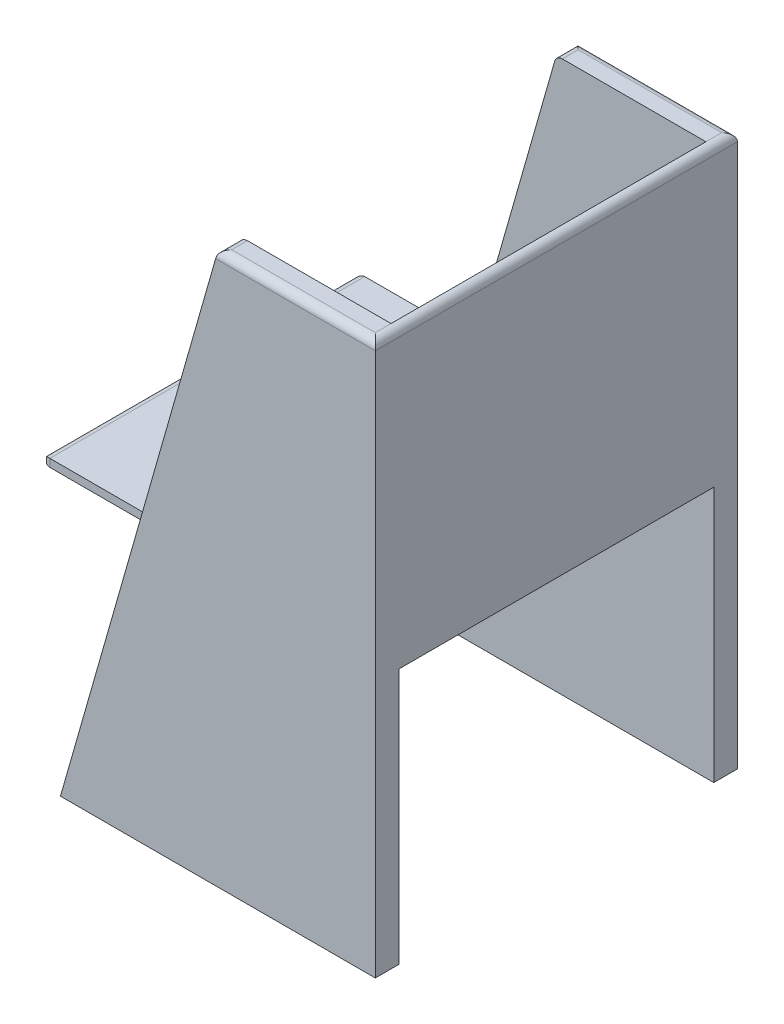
ISO-10303-21;
HEADER;
FILE_DESCRIPTION(('STEP AP214'),'2;1');
FILE_NAME('part.step','',(''),(''),'','','');
FILE_SCHEMA(('AUTOMOTIVE_DESIGN { 1 0 10303 214 1 1 1 1 }'));
ENDSEC;
DATA;
#1=APPLICATION_CONTEXT('core data for automotive mechanical design processes');
#2=APPLICATION_PROTOCOL_DEFINITION('international standard','automotive_design',2000,#1);
#3=PRODUCT_CONTEXT('',#1,'mechanical');
#4=PRODUCT('Part','Part','',(#3));
#5=PRODUCT_RELATED_PRODUCT_CATEGORY('part','',(#4));
#6=PRODUCT_DEFINITION_FORMATION('','',#4);
#7=PRODUCT_DEFINITION_CONTEXT('part definition',#1,'design');
#8=PRODUCT_DEFINITION('design','',#6,#7);
#9=PRODUCT_DEFINITION_SHAPE('','',#8);
#10=(LENGTH_UNIT() NAMED_UNIT(*) SI_UNIT(.MILLI.,.METRE.));
#11=(NAMED_UNIT(*) PLANE_ANGLE_UNIT() SI_UNIT($,.RADIAN.));
#12=(NAMED_UNIT(*) SI_UNIT($,.STERADIAN.) SOLID_ANGLE_UNIT());
#13=UNCERTAINTY_MEASURE_WITH_UNIT(LENGTH_MEASURE(1.E-05),#10,'distance_accuracy_value','');
#14=(GEOMETRIC_REPRESENTATION_CONTEXT(3) GLOBAL_UNCERTAINTY_ASSIGNED_CONTEXT((#13)) GLOBAL_UNIT_ASSIGNED_CONTEXT((#10,
#11,#12)) REPRESENTATION_CONTEXT('',''));
#15=CARTESIAN_POINT('',(0.,0.,0.));
#16=DIRECTION('',(0.,0.,1.));
#17=DIRECTION('',(1.,0.,0.));
#18=AXIS2_PLACEMENT_3D('',#15,#16,#17);
#19=CARTESIAN_POINT('',(400.,700.,30.));
#20=DIRECTION('',(0.,-1.,0.));
#21=DIRECTION('',(0.,0.,-1.));
#22=AXIS2_PLACEMENT_3D('',#19,#20,#21);
#23=PLANE('',#22);
#24=DIRECTION('',(-1.,0.,0.));
#25=VECTOR('',#24,1.);
#26=CARTESIAN_POINT('',(400.,700.,430.));
#27=LINE('',#26,#25);
#28=CARTESIAN_POINT('',(390.,700.,430.));
#29=VERTEX_POINT('',#28);
#30=CARTESIAN_POINT('',(207.543014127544,700.,430.));
#31=VERTEX_POINT('',#30);
#32=EDGE_CURVE('E192',#29,#31,#27,.T.);
#33=ORIENTED_EDGE('',*,*,#32,.T.);
#34=DIRECTION('',(0.,0.,1.));
#35=VECTOR('',#34,1.);
#36=CARTESIAN_POINT('',(207.543014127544,700.,460.));
#37=LINE('',#36,#35);
#38=CARTESIAN_POINT('',(207.543014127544,700.,450.));
#39=VERTEX_POINT('',#38);
#40=EDGE_CURVE('E213',#31,#39,#37,.T.);
#41=ORIENTED_EDGE('',*,*,#40,.T.);
#42=DIRECTION('',(-1.,0.,0.));
#43=VECTOR('',#42,1.);
#44=CARTESIAN_POINT('',(400.,700.,450.));
#45=LINE('',#44,#43);
#46=CARTESIAN_POINT('',(390.,700.,450.));
#47=VERTEX_POINT('',#46);
#48=EDGE_CURVE('E211',#39,#47,#45,.F.);
#49=ORIENTED_EDGE('',*,*,#48,.T.);
#50=DIRECTION('',(0.,0.,-1.));
#51=VECTOR('',#50,1.);
#52=CARTESIAN_POINT('',(390.,700.,30.));
#53=LINE('',#52,#51);
#54=EDGE_CURVE('E209',#47,#29,#53,.T.);
#55=ORIENTED_EDGE('',*,*,#54,.T.);
#56=EDGE_LOOP('',(#33,#41,#49,#55));
#57=FACE_BOUND('',#56,.T.);
#58=ADVANCED_FACE('F33',(#57),#23,.F.);
#59=CARTESIAN_POINT('',(0.,0.,30.));
#60=DIRECTION('',(0.,0.,1.));
#61=DIRECTION('',(1.,0.,0.));
#62=AXIS2_PLACEMENT_3D('',#59,#60,#61);
#63=PLANE('',#62);
#64=DIRECTION('',(1.,0.,0.));
#65=VECTOR('',#64,1.);
#66=CARTESIAN_POINT('',(0.,325.,30.));
#67=LINE('',#66,#65);
#68=CARTESIAN_POINT('',(92.8571428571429,325.,29.9999999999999));
#69=VERTEX_POINT('',#68);
#70=CARTESIAN_POINT('',(400.,325.,30.));
#71=VERTEX_POINT('',#70);
#72=EDGE_CURVE('E289',#69,#71,#67,.T.);
#73=ORIENTED_EDGE('',*,*,#72,.F.);
#74=DIRECTION('',(-0.274721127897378,-0.961523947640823,0.));
#75=VECTOR('',#74,1.);
#76=CARTESIAN_POINT('',(200.,700.,30.));
#77=LINE('',#76,#75);
#78=CARTESIAN_POINT('',(0.,0.,30.));
#79=VERTEX_POINT('',#78);
#80=EDGE_CURVE('E273',#69,#79,#77,.T.);
#81=ORIENTED_EDGE('',*,*,#80,.T.);
#82=DIRECTION('',(1.,0.,0.));
#83=VECTOR('',#82,1.);
#84=CARTESIAN_POINT('',(0.,0.,30.));
#85=LINE('',#84,#83);
#86=CARTESIAN_POINT('',(400.,0.,30.));
#87=VERTEX_POINT('',#86);
#88=EDGE_CURVE('E283',#79,#87,#85,.T.);
#89=ORIENTED_EDGE('',*,*,#88,.T.);
#90=DIRECTION('',(0.,1.,0.));
#91=VECTOR('',#90,1.);
#92=CARTESIAN_POINT('',(400.,0.,30.));
#93=LINE('',#92,#91);
#94=EDGE_CURVE('E274',#87,#71,#93,.T.);
#95=ORIENTED_EDGE('',*,*,#94,.T.);
#96=EDGE_LOOP('',(#73,#81,#89,#95));
#97=FACE_BOUND('',#96,.T.);
#98=ADVANCED_FACE('F342',(#97),#63,.T.);
#99=CARTESIAN_POINT('',(0.,0.,430.));
#100=DIRECTION('',(0.,0.,-1.));
#101=DIRECTION('',(1.,0.,0.));
#102=AXIS2_PLACEMENT_3D('',#99,#100,#101);
#103=PLANE('',#102);
#104=DIRECTION('',(-0.274721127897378,-0.961523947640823,0.));
#105=VECTOR('',#104,1.);
#106=CARTESIAN_POINT('',(200.,700.,430.));
#107=LINE('',#106,#105);
#108=CARTESIAN_POINT('',(92.8571428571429,325.,430.));
#109=VERTEX_POINT('',#108);
#110=CARTESIAN_POINT('',(0.,0.,430.));
#111=VERTEX_POINT('',#110);
#112=EDGE_CURVE('E611',#109,#111,#107,.T.);
#113=ORIENTED_EDGE('',*,*,#112,.F.);
#114=DIRECTION('',(1.,0.,0.));
#115=VECTOR('',#114,1.);
#116=CARTESIAN_POINT('',(390.,325.,430.));
#117=LINE('',#116,#115);
#118=CARTESIAN_POINT('',(400.,325.,430.));
#119=VERTEX_POINT('',#118);
#120=EDGE_CURVE('E332',#109,#119,#117,.T.);
#121=ORIENTED_EDGE('',*,*,#120,.T.);
#122=DIRECTION('',(0.,1.,0.));
#123=VECTOR('',#122,1.);
#124=CARTESIAN_POINT('',(400.,0.,430.));
#125=LINE('',#124,#123);
#126=CARTESIAN_POINT('',(400.,0.,430.));
#127=VERTEX_POINT('',#126);
#128=EDGE_CURVE('E326',#127,#119,#125,.T.);
#129=ORIENTED_EDGE('',*,*,#128,.F.);
#130=DIRECTION('',(1.,0.,0.));
#131=VECTOR('',#130,1.);
#132=CARTESIAN_POINT('',(0.,0.,430.));
#133=LINE('',#132,#131);
#134=EDGE_CURVE('E606',#111,#127,#133,.T.);
#135=ORIENTED_EDGE('',*,*,#134,.F.);
#136=EDGE_LOOP('',(#113,#121,#129,#135));
#137=FACE_BOUND('',#136,.T.);
#138=ADVANCED_FACE('F370',(#137),#103,.T.);
#139=CARTESIAN_POINT('',(400.,0.,30.));
#140=DIRECTION('',(-1.,0.,0.));
#141=DIRECTION('',(0.,0.,1.));
#142=AXIS2_PLACEMENT_3D('',#139,#140,#141);
#143=PLANE('',#142);
#144=DIRECTION('',(0.,1.,0.));
#145=VECTOR('',#144,1.);
#146=CARTESIAN_POINT('',(400.,0.,0.));
#147=LINE('',#146,#145);
#148=CARTESIAN_POINT('',(400.,0.,0.));
#149=VERTEX_POINT('',#148);
#150=CARTESIAN_POINT('',(400.,690.,0.));
#151=VERTEX_POINT('',#150);
#152=EDGE_CURVE('E285',#149,#151,#147,.T.);
#153=ORIENTED_EDGE('',*,*,#152,.T.);
#154=DIRECTION('',(0.,0.,-1.));
#155=VECTOR('',#154,1.);
#156=CARTESIAN_POINT('',(400.,690.,30.));
#157=LINE('',#156,#155);
#158=CARTESIAN_POINT('',(400.,690.,460.));
#159=VERTEX_POINT('',#158);
#160=EDGE_CURVE('E230',#151,#159,#157,.F.);
#161=ORIENTED_EDGE('',*,*,#160,.T.);
#162=DIRECTION('',(0.,1.,0.));
#163=VECTOR('',#162,1.);
#164=CARTESIAN_POINT('',(400.,0.,460.));
#165=LINE('',#164,#163);
#166=CARTESIAN_POINT('',(400.,0.,460.));
#167=VERTEX_POINT('',#166);
#168=EDGE_CURVE('E309',#167,#159,#165,.T.);
#169=ORIENTED_EDGE('',*,*,#168,.F.);
#170=DIRECTION('',(0.,0.,1.));
#171=VECTOR('',#170,1.);
#172=CARTESIAN_POINT('',(400.,0.,430.));
#173=LINE('',#172,#171);
#174=EDGE_CURVE('E330',#127,#167,#173,.T.);
#175=ORIENTED_EDGE('',*,*,#174,.F.);
#176=ORIENTED_EDGE('',*,*,#128,.T.);
#177=DIRECTION('',(0.,0.,-1.));
#178=VECTOR('',#177,1.);
#179=CARTESIAN_POINT('',(400.,325.,450.));
#180=LINE('',#179,#178);
#181=EDGE_CURVE('E334',#119,#71,#180,.T.);
#182=ORIENTED_EDGE('',*,*,#181,.T.);
#183=ORIENTED_EDGE('',*,*,#94,.F.);
#184=DIRECTION('',(0.,0.,-1.));
#185=VECTOR('',#184,1.);
#186=CARTESIAN_POINT('',(400.,0.,30.));
#187=LINE('',#186,#185);
#188=EDGE_CURVE('E200',#87,#149,#187,.T.);
#189=ORIENTED_EDGE('',*,*,#188,.T.);
#190=EDGE_LOOP('',(#153,#161,#169,#175,#176,#182,#183,#189));
#191=FACE_BOUND('',#190,.T.);
#192=ADVANCED_FACE('F296',(#191),#143,.F.);
#193=DIRECTION('',(-1.,0.,0.));
#194=VECTOR('',#193,1.);
#195=CARTESIAN_POINT('',(400.,700.,30.));
#196=LINE('',#195,#194);
#197=CARTESIAN_POINT('',(390.,700.,30.));
#198=VERTEX_POINT('',#197);
#199=CARTESIAN_POINT('',(207.543014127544,700.,30.));
#200=VERTEX_POINT('',#199);
#201=EDGE_CURVE('E269',#198,#200,#196,.T.);
#202=ORIENTED_EDGE('',*,*,#201,.F.);
#203=DIRECTION('',(0.,0.,-1.));
#204=VECTOR('',#203,1.);
#205=CARTESIAN_POINT('',(390.,700.,30.));
#206=LINE('',#205,#204);
#207=CARTESIAN_POINT('',(390.,700.,10.));
#208=VERTEX_POINT('',#207);
#209=EDGE_CURVE('E207',#198,#208,#206,.T.);
#210=ORIENTED_EDGE('',*,*,#209,.T.);
#211=DIRECTION('',(-1.,0.,0.));
#212=VECTOR('',#211,1.);
#213=CARTESIAN_POINT('',(400.,700.,10.));
#214=LINE('',#213,#212);
#215=CARTESIAN_POINT('',(207.543014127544,700.,10.));
#216=VERTEX_POINT('',#215);
#217=EDGE_CURVE('E205',#208,#216,#214,.T.);
#218=ORIENTED_EDGE('',*,*,#217,.T.);
#219=DIRECTION('',(0.,0.,-1.));
#220=VECTOR('',#219,1.);
#221=CARTESIAN_POINT('',(207.543014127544,700.,30.));
#222=LINE('',#221,#220);
#223=EDGE_CURVE('E197',#216,#200,#222,.F.);
#224=ORIENTED_EDGE('',*,*,#223,.T.);
#225=EDGE_LOOP('',(#202,#210,#218,#224));
#226=FACE_BOUND('',#225,.T.);
#227=ADVANCED_FACE('F268',(#226),#23,.F.);
#228=CARTESIAN_POINT('',(200.,700.,30.));
#229=DIRECTION('',(0.961523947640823,-0.274721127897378,0.));
#230=DIRECTION('',(0.274721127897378,0.961523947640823,0.));
#231=AXIS2_PLACEMENT_3D('',#228,#229,#230);
#232=PLANE('',#231);
#233=DIRECTION('',(0.,0.,-1.));
#234=VECTOR('',#233,1.);
#235=CARTESIAN_POINT('',(197.927774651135,692.747211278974,30.));
#236=LINE('',#235,#234);
#237=CARTESIAN_POINT('',(197.927774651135,692.747211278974,30.));
#238=VERTEX_POINT('',#237);
#239=CARTESIAN_POINT('',(197.927774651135,692.747211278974,0.384760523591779));
#240=VERTEX_POINT('',#239);
#241=EDGE_CURVE('E224',#238,#240,#236,.T.);
#242=ORIENTED_EDGE('',*,*,#241,.T.);
#243=CARTESIAN_POINT('',(197.142857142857,690.,10.));
#244=DIRECTION('',(0.961523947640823,-0.274721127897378,0.));
#245=DIRECTION('',(-0.274721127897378,-0.961523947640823,0.));
#246=AXIS2_PLACEMENT_3D('',#243,#244,#245);
#247=ELLIPSE('',#246,10.4001569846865,10.);
#248=CARTESIAN_POINT('',(197.142857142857,690.,0.));
#249=VERTEX_POINT('',#248);
#250=EDGE_CURVE('E226',#240,#249,#247,.F.);
#251=ORIENTED_EDGE('',*,*,#250,.T.);
#252=DIRECTION('',(-0.274721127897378,-0.961523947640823,0.));
#253=VECTOR('',#252,1.);
#254=CARTESIAN_POINT('',(200.,700.,0.));
#255=LINE('',#254,#253);
#256=CARTESIAN_POINT('',(0.,0.,0.));
#257=VERTEX_POINT('',#256);
#258=EDGE_CURVE('E288',#249,#257,#255,.T.);
#259=ORIENTED_EDGE('',*,*,#258,.T.);
#260=DIRECTION('',(0.,0.,-1.));
#261=VECTOR('',#260,1.);
#262=CARTESIAN_POINT('',(0.,0.,30.));
#263=LINE('',#262,#261);
#264=EDGE_CURVE('E195',#79,#257,#263,.T.);
#265=ORIENTED_EDGE('',*,*,#264,.F.);
#266=ORIENTED_EDGE('',*,*,#80,.F.);
#267=DIRECTION('',(0.274721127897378,0.961523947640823,0.));
#268=VECTOR('',#267,1.);
#269=CARTESIAN_POINT('',(200.,700.,29.9999999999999));
#270=LINE('',#269,#268);
#271=CARTESIAN_POINT('',(95.7142857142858,335.,29.9999999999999));
#272=VERTEX_POINT('',#271);
#273=EDGE_CURVE('E320',#69,#272,#270,.T.);
#274=ORIENTED_EDGE('',*,*,#273,.T.);
#275=EDGE_CURVE('E276',#238,#272,#77,.T.);
#276=ORIENTED_EDGE('',*,*,#275,.F.);
#277=EDGE_LOOP('',(#242,#251,#259,#265,#266,#274,#276));
#278=FACE_BOUND('',#277,.T.);
#279=ADVANCED_FACE('F353',(#278),#232,.F.);
#280=CARTESIAN_POINT('',(0.,0.,30.));
#281=DIRECTION('',(0.,1.,0.));
#282=DIRECTION('',(0.,0.,1.));
#283=AXIS2_PLACEMENT_3D('',#280,#281,#282);
#284=PLANE('',#283);
#285=DIRECTION('',(1.,0.,0.));
#286=VECTOR('',#285,1.);
#287=CARTESIAN_POINT('',(0.,0.,0.));
#288=LINE('',#287,#286);
#289=EDGE_CURVE('E279',#257,#149,#288,.T.);
#290=ORIENTED_EDGE('',*,*,#289,.T.);
#291=ORIENTED_EDGE('',*,*,#188,.F.);
#292=ORIENTED_EDGE('',*,*,#88,.F.);
#293=ORIENTED_EDGE('',*,*,#264,.T.);
#294=EDGE_LOOP('',(#290,#291,#292,#293));
#295=FACE_BOUND('',#294,.T.);
#296=ADVANCED_FACE('F354',(#295),#284,.F.);
#297=ORIENTED_EDGE('',*,*,#201,.T.);
#298=CARTESIAN_POINT('',(207.543014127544,690.,30.));
#299=DIRECTION('',(0.,0.,1.));
#300=DIRECTION('',(1.,0.,0.));
#301=AXIS2_PLACEMENT_3D('',#298,#299,#300);
#302=CIRCLE('',#301,10.);
#303=EDGE_CURVE('E232',#200,#238,#302,.T.);
#304=ORIENTED_EDGE('',*,*,#303,.T.);
#305=ORIENTED_EDGE('',*,*,#275,.T.);
#306=DIRECTION('',(1.,0.,0.));
#307=VECTOR('',#306,1.);
#308=CARTESIAN_POINT('',(390.,335.,30.));
#309=LINE('',#308,#307);
#310=CARTESIAN_POINT('',(390.,335.,30.));
#311=VERTEX_POINT('',#310);
#312=EDGE_CURVE('E178',#272,#311,#309,.T.);
#313=ORIENTED_EDGE('',*,*,#312,.T.);
#314=DIRECTION('',(0.,1.,0.));
#315=VECTOR('',#314,1.);
#316=CARTESIAN_POINT('',(390.,0.,30.));
#317=LINE('',#316,#315);
#318=EDGE_CURVE('E187',#311,#198,#317,.T.);
#319=ORIENTED_EDGE('',*,*,#318,.T.);
#320=EDGE_LOOP('',(#297,#304,#305,#313,#319));
#321=FACE_BOUND('',#320,.T.);
#322=ADVANCED_FACE('F271',(#321),#63,.T.);
#323=CARTESIAN_POINT('',(0.,0.,0.));
#324=DIRECTION('',(0.,0.,1.));
#325=DIRECTION('',(1.,0.,0.));
#326=AXIS2_PLACEMENT_3D('',#323,#324,#325);
#327=PLANE('',#326);
#328=ORIENTED_EDGE('',*,*,#258,.F.);
#329=DIRECTION('',(-1.,0.,0.));
#330=VECTOR('',#329,1.);
#331=CARTESIAN_POINT('',(0.,690.,0.));
#332=LINE('',#331,#330);
#333=EDGE_CURVE('E228',#249,#151,#332,.F.);
#334=ORIENTED_EDGE('',*,*,#333,.T.);
#335=ORIENTED_EDGE('',*,*,#152,.F.);
#336=ORIENTED_EDGE('',*,*,#289,.F.);
#337=EDGE_LOOP('',(#328,#334,#335,#336));
#338=FACE_BOUND('',#337,.T.);
#339=ADVANCED_FACE('F302',(#338),#327,.F.);
#340=CARTESIAN_POINT('',(390.,325.,450.));
#341=DIRECTION('',(0.,-1.,0.));
#342=DIRECTION('',(0.,0.,-1.));
#343=AXIS2_PLACEMENT_3D('',#340,#341,#342);
#344=PLANE('',#343);
#345=DIRECTION('',(0.,0.,-1.));
#346=VECTOR('',#345,1.);
#347=CARTESIAN_POINT('',(-53.4845159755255,325.,430.));
#348=LINE('',#347,#346);
#349=CARTESIAN_POINT('',(-53.4845159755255,325.,420.));
#350=VERTEX_POINT('',#349);
#351=CARTESIAN_POINT('',(-53.4845159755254,325.,39.9999999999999));
#352=VERTEX_POINT('',#351);
#353=EDGE_CURVE('E618',#350,#352,#348,.T.);
#354=ORIENTED_EDGE('',*,*,#353,.T.);
#355=CARTESIAN_POINT('',(-43.4845159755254,325.,39.9999999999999));
#356=DIRECTION('',(0.,-1.,0.));
#357=DIRECTION('',(0.,0.,-1.));
#358=AXIS2_PLACEMENT_3D('',#355,#356,#357);
#359=CIRCLE('',#358,10.);
#360=CARTESIAN_POINT('',(-43.4845159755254,325.,29.9999999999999));
#361=VERTEX_POINT('',#360);
#362=EDGE_CURVE('E50',#352,#361,#359,.T.);
#363=ORIENTED_EDGE('',*,*,#362,.T.);
#364=DIRECTION('',(1.,0.,0.));
#365=VECTOR('',#364,1.);
#366=CARTESIAN_POINT('',(390.,325.,30.));
#367=LINE('',#366,#365);
#368=EDGE_CURVE('E188',#361,#69,#367,.T.);
#369=ORIENTED_EDGE('',*,*,#368,.T.);
#370=ORIENTED_EDGE('',*,*,#72,.T.);
#371=ORIENTED_EDGE('',*,*,#181,.F.);
#372=ORIENTED_EDGE('',*,*,#120,.F.);
#373=DIRECTION('',(-1.,0.,0.));
#374=VECTOR('',#373,1.);
#375=CARTESIAN_POINT('',(390.,325.,430.));
#376=LINE('',#375,#374);
#377=CARTESIAN_POINT('',(-43.4845159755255,325.,430.));
#378=VERTEX_POINT('',#377);
#379=EDGE_CURVE('E243',#109,#378,#376,.T.);
#380=ORIENTED_EDGE('',*,*,#379,.T.);
#381=CARTESIAN_POINT('',(-43.4845159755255,325.,420.));
#382=DIRECTION('',(0.,-1.,0.));
#383=DIRECTION('',(0.,0.,-1.));
#384=AXIS2_PLACEMENT_3D('',#381,#382,#383);
#385=CIRCLE('',#384,10.);
#386=EDGE_CURVE('E234',#378,#350,#385,.T.);
#387=ORIENTED_EDGE('',*,*,#386,.T.);
#388=EDGE_LOOP('',(#354,#363,#369,#370,#371,#372,#380,#387));
#389=FACE_BOUND('',#388,.T.);
#390=ADVANCED_FACE('F339',(#389),#344,.T.);
#391=CARTESIAN_POINT('',(390.,0.,0.));
#392=DIRECTION('',(1.,0.,0.));
#393=DIRECTION('',(0.,0.,-1.));
#394=AXIS2_PLACEMENT_3D('',#391,#392,#393);
#395=PLANE('',#394);
#396=ORIENTED_EDGE('',*,*,#318,.F.);
#397=DIRECTION('',(0.,0.,1.));
#398=VECTOR('',#397,1.);
#399=CARTESIAN_POINT('',(390.,335.,430.));
#400=LINE('',#399,#398);
#401=CARTESIAN_POINT('',(390.,335.,430.));
#402=VERTEX_POINT('',#401);
#403=EDGE_CURVE('E172',#311,#402,#400,.T.);
#404=ORIENTED_EDGE('',*,*,#403,.T.);
#405=DIRECTION('',(0.,1.,0.));
#406=VECTOR('',#405,1.);
#407=CARTESIAN_POINT('',(390.,0.,430.));
#408=LINE('',#407,#406);
#409=EDGE_CURVE('E185',#402,#29,#408,.T.);
#410=ORIENTED_EDGE('',*,*,#409,.T.);
#411=DIRECTION('',(0.,0.,1.));
#412=VECTOR('',#411,1.);
#413=CARTESIAN_POINT('',(390.,700.,430.));
#414=LINE('',#413,#412);
#415=EDGE_CURVE('E316',#198,#29,#414,.T.);
#416=ORIENTED_EDGE('',*,*,#415,.F.);
#417=EDGE_LOOP('',(#396,#404,#410,#416));
#418=FACE_BOUND('',#417,.T.);
#419=ADVANCED_FACE('F183',(#418),#395,.F.);
#420=CARTESIAN_POINT('',(0.,0.,430.));
#421=DIRECTION('',(0.,-1.,0.));
#422=DIRECTION('',(0.,0.,-1.));
#423=AXIS2_PLACEMENT_3D('',#420,#421,#422);
#424=PLANE('',#423);
#425=DIRECTION('',(1.,0.,0.));
#426=VECTOR('',#425,1.);
#427=CARTESIAN_POINT('',(0.,0.,460.));
#428=LINE('',#427,#426);
#429=CARTESIAN_POINT('',(0.,0.,460.));
#430=VERTEX_POINT('',#429);
#431=EDGE_CURVE('E315',#430,#167,#428,.T.);
#432=ORIENTED_EDGE('',*,*,#431,.F.);
#433=DIRECTION('',(0.,0.,1.));
#434=VECTOR('',#433,1.);
#435=CARTESIAN_POINT('',(0.,0.,430.));
#436=LINE('',#435,#434);
#437=EDGE_CURVE('E327',#111,#430,#436,.T.);
#438=ORIENTED_EDGE('',*,*,#437,.F.);
#439=ORIENTED_EDGE('',*,*,#134,.T.);
#440=ORIENTED_EDGE('',*,*,#174,.T.);
#441=EDGE_LOOP('',(#432,#438,#439,#440));
#442=FACE_BOUND('',#441,.T.);
#443=ADVANCED_FACE('F458',(#442),#424,.T.);
#444=CARTESIAN_POINT('',(200.,700.,430.));
#445=DIRECTION('',(-0.961523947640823,0.274721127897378,0.));
#446=DIRECTION('',(-0.274721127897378,-0.961523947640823,0.));
#447=AXIS2_PLACEMENT_3D('',#444,#445,#446);
#448=PLANE('',#447);
#449=CARTESIAN_POINT('',(197.142857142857,690.,450.));
#450=DIRECTION('',(-0.961523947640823,0.274721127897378,0.));
#451=DIRECTION('',(-0.274721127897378,-0.961523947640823,0.));
#452=AXIS2_PLACEMENT_3D('',#449,#450,#451);
#453=ELLIPSE('',#452,10.4001569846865,10.);
#454=CARTESIAN_POINT('',(197.142857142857,690.,460.));
#455=VERTEX_POINT('',#454);
#456=CARTESIAN_POINT('',(197.927774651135,692.747211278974,459.615239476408));
#457=VERTEX_POINT('',#456);
#458=EDGE_CURVE('E216',#455,#457,#453,.T.);
#459=ORIENTED_EDGE('',*,*,#458,.T.);
#460=DIRECTION('',(0.,0.,1.));
#461=VECTOR('',#460,1.);
#462=CARTESIAN_POINT('',(197.927774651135,692.747211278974,430.));
#463=LINE('',#462,#461);
#464=CARTESIAN_POINT('',(197.927774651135,692.747211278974,430.));
#465=VERTEX_POINT('',#464);
#466=EDGE_CURVE('E218',#457,#465,#463,.F.);
#467=ORIENTED_EDGE('',*,*,#466,.T.);
#468=CARTESIAN_POINT('',(95.7142857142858,335.,430.));
#469=VERTEX_POINT('',#468);
#470=EDGE_CURVE('E613',#465,#469,#107,.T.);
#471=ORIENTED_EDGE('',*,*,#470,.T.);
#472=EDGE_CURVE('E614',#469,#109,#107,.T.);
#473=ORIENTED_EDGE('',*,*,#472,.T.);
#474=ORIENTED_EDGE('',*,*,#112,.T.);
#475=ORIENTED_EDGE('',*,*,#437,.T.);
#476=DIRECTION('',(-0.274721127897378,-0.961523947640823,0.));
#477=VECTOR('',#476,1.);
#478=CARTESIAN_POINT('',(200.,700.,460.));
#479=LINE('',#478,#477);
#480=EDGE_CURVE('E318',#455,#430,#479,.T.);
#481=ORIENTED_EDGE('',*,*,#480,.F.);
#482=EDGE_LOOP('',(#459,#467,#471,#473,#474,#475,#481));
#483=FACE_BOUND('',#482,.T.);
#484=ADVANCED_FACE('F452',(#483),#448,.T.);
#485=ORIENTED_EDGE('',*,*,#470,.F.);
#486=CARTESIAN_POINT('',(207.543014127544,690.,430.));
#487=DIRECTION('',(0.,0.,-1.));
#488=DIRECTION('',(-1.,0.,0.));
#489=AXIS2_PLACEMENT_3D('',#486,#487,#488);
#490=CIRCLE('',#489,10.);
#491=EDGE_CURVE('E220',#465,#31,#490,.T.);
#492=ORIENTED_EDGE('',*,*,#491,.T.);
#493=ORIENTED_EDGE('',*,*,#32,.F.);
#494=ORIENTED_EDGE('',*,*,#409,.F.);
#495=DIRECTION('',(-1.,0.,0.));
#496=VECTOR('',#495,1.);
#497=CARTESIAN_POINT('',(390.,335.,430.));
#498=LINE('',#497,#496);
#499=EDGE_CURVE('E167',#402,#469,#498,.T.);
#500=ORIENTED_EDGE('',*,*,#499,.T.);
#501=EDGE_LOOP('',(#485,#492,#493,#494,#500));
#502=FACE_BOUND('',#501,.T.);
#503=ADVANCED_FACE('F190',(#502),#103,.T.);
#504=CARTESIAN_POINT('',(0.,0.,460.));
#505=DIRECTION('',(0.,0.,-1.));
#506=DIRECTION('',(1.,0.,0.));
#507=AXIS2_PLACEMENT_3D('',#504,#505,#506);
#508=PLANE('',#507);
#509=ORIENTED_EDGE('',*,*,#168,.T.);
#510=DIRECTION('',(-1.,0.,0.));
#511=VECTOR('',#510,1.);
#512=CARTESIAN_POINT('',(0.,690.,460.));
#513=LINE('',#512,#511);
#514=EDGE_CURVE('E222',#159,#455,#513,.T.);
#515=ORIENTED_EDGE('',*,*,#514,.T.);
#516=ORIENTED_EDGE('',*,*,#480,.T.);
#517=ORIENTED_EDGE('',*,*,#431,.T.);
#518=EDGE_LOOP('',(#509,#515,#516,#517));
#519=FACE_BOUND('',#518,.T.);
#520=ADVANCED_FACE('F312',(#519),#508,.F.);
#521=CARTESIAN_POINT('',(390.,335.,30.));
#522=DIRECTION('',(0.,0.,-1.));
#523=DIRECTION('',(-1.,0.,0.));
#524=AXIS2_PLACEMENT_3D('',#521,#522,#523);
#525=PLANE('',#524);
#526=ORIENTED_EDGE('',*,*,#368,.F.);
#527=DIRECTION('',(0.,-1.,0.));
#528=VECTOR('',#527,1.);
#529=CARTESIAN_POINT('',(-43.4845159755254,335.,29.9999999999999));
#530=LINE('',#529,#528);
#531=CARTESIAN_POINT('',(-43.4845159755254,335.,29.9999999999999));
#532=VERTEX_POINT('',#531);
#533=EDGE_CURVE('E42',#361,#532,#530,.F.);
#534=ORIENTED_EDGE('',*,*,#533,.T.);
#535=EDGE_CURVE('E350',#532,#272,#309,.T.);
#536=ORIENTED_EDGE('',*,*,#535,.T.);
#537=ORIENTED_EDGE('',*,*,#273,.F.);
#538=EDGE_LOOP('',(#526,#534,#536,#537));
#539=FACE_BOUND('',#538,.T.);
#540=ADVANCED_FACE('F348',(#539),#525,.T.);
#541=CARTESIAN_POINT('',(390.,335.,430.));
#542=DIRECTION('',(0.,0.,1.));
#543=DIRECTION('',(1.,0.,0.));
#544=AXIS2_PLACEMENT_3D('',#541,#542,#543);
#545=PLANE('',#544);
#546=CARTESIAN_POINT('',(-43.4845159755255,335.,430.));
#547=VERTEX_POINT('',#546);
#548=EDGE_CURVE('E174',#469,#547,#498,.T.);
#549=ORIENTED_EDGE('',*,*,#548,.T.);
#550=DIRECTION('',(0.,-1.,0.));
#551=VECTOR('',#550,1.);
#552=CARTESIAN_POINT('',(-43.4845159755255,335.,430.));
#553=LINE('',#552,#551);
#554=EDGE_CURVE('E11',#547,#378,#553,.T.);
#555=ORIENTED_EDGE('',*,*,#554,.T.);
#556=ORIENTED_EDGE('',*,*,#379,.F.);
#557=ORIENTED_EDGE('',*,*,#472,.F.);
#558=EDGE_LOOP('',(#549,#555,#556,#557));
#559=FACE_BOUND('',#558,.T.);
#560=ADVANCED_FACE('F427',(#559),#545,.T.);
#561=CARTESIAN_POINT('',(0.,335.,0.));
#562=DIRECTION('',(0.,1.,0.));
#563=DIRECTION('',(0.,0.,1.));
#564=AXIS2_PLACEMENT_3D('',#561,#562,#563);
#565=PLANE('',#564);
#566=ORIENTED_EDGE('',*,*,#535,.F.);
#567=DIRECTION('',(0.,0.,-1.));
#568=VECTOR('',#567,1.);
#569=CARTESIAN_POINT('',(-43.4845159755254,335.,0.));
#570=LINE('',#569,#568);
#571=EDGE_CURVE('E194',#532,#547,#570,.F.);
#572=ORIENTED_EDGE('',*,*,#571,.T.);
#573=ORIENTED_EDGE('',*,*,#548,.F.);
#574=ORIENTED_EDGE('',*,*,#499,.F.);
#575=ORIENTED_EDGE('',*,*,#403,.F.);
#576=ORIENTED_EDGE('',*,*,#312,.F.);
#577=EDGE_LOOP('',(#566,#572,#573,#574,#575,#576));
#578=FACE_BOUND('',#577,.T.);
#579=ADVANCED_FACE('F170',(#578),#565,.T.);
#580=CARTESIAN_POINT('',(-43.4845159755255,335.,420.));
#581=DIRECTION('',(0.,-1.,0.));
#582=DIRECTION('',(0.,0.,-1.));
#583=AXIS2_PLACEMENT_3D('',#580,#581,#582);
#584=CYLINDRICAL_SURFACE('',#583,10.);
#585=ORIENTED_EDGE('',*,*,#386,.F.);
#586=ORIENTED_EDGE('',*,*,#554,.F.);
#587=CARTESIAN_POINT('',(-43.4845159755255,325.,420.));
#588=DIRECTION('',(0.,-0.707106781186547,0.707106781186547));
#589=DIRECTION('',(0.,-0.707106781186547,-0.707106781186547));
#590=AXIS2_PLACEMENT_3D('',#587,#588,#589);
#591=ELLIPSE('',#590,14.1421356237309,10.);
#592=EDGE_CURVE('E240',#350,#547,#591,.F.);
#593=ORIENTED_EDGE('',*,*,#592,.F.);
#594=EDGE_LOOP('',(#585,#586,#593));
#595=FACE_BOUND('',#594,.T.);
#596=ADVANCED_FACE('F389',(#595),#584,.T.);
#597=CARTESIAN_POINT('',(-43.4845159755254,335.,39.9999999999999));
#598=DIRECTION('',(0.,-1.,0.));
#599=DIRECTION('',(0.,0.,-1.));
#600=AXIS2_PLACEMENT_3D('',#597,#598,#599);
#601=CYLINDRICAL_SURFACE('',#600,10.);
#602=ORIENTED_EDGE('',*,*,#533,.F.);
#603=ORIENTED_EDGE('',*,*,#362,.F.);
#604=CARTESIAN_POINT('',(-43.4845159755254,325.,39.9999999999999));
#605=DIRECTION('',(0.,-0.707106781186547,-0.707106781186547));
#606=DIRECTION('',(0.,-0.707106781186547,0.707106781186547));
#607=AXIS2_PLACEMENT_3D('',#604,#605,#606);
#608=ELLIPSE('',#607,14.1421356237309,10.);
#609=EDGE_CURVE('E238',#532,#352,#608,.F.);
#610=ORIENTED_EDGE('',*,*,#609,.F.);
#611=EDGE_LOOP('',(#602,#603,#610));
#612=FACE_BOUND('',#611,.T.);
#613=ADVANCED_FACE('F385',(#612),#601,.T.);
#614=CARTESIAN_POINT('',(-43.4845159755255,325.,430.));
#615=DIRECTION('',(0.,0.,-1.));
#616=DIRECTION('',(-1.,0.,0.));
#617=AXIS2_PLACEMENT_3D('',#614,#615,#616);
#618=CYLINDRICAL_SURFACE('',#617,10.);
#619=ORIENTED_EDGE('',*,*,#592,.T.);
#620=ORIENTED_EDGE('',*,*,#571,.F.);
#621=ORIENTED_EDGE('',*,*,#609,.T.);
#622=ORIENTED_EDGE('',*,*,#353,.F.);
#623=EDGE_LOOP('',(#619,#620,#621,#622));
#624=FACE_BOUND('',#623,.T.);
#625=ADVANCED_FACE('F382',(#624),#618,.T.);
#626=CARTESIAN_POINT('',(207.543014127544,690.,30.));
#627=DIRECTION('',(0.,0.,-1.));
#628=DIRECTION('',(-1.,0.,0.));
#629=AXIS2_PLACEMENT_3D('',#626,#627,#628);
#630=CYLINDRICAL_SURFACE('',#629,10.);
#631=ORIENTED_EDGE('',*,*,#303,.F.);
#632=ORIENTED_EDGE('',*,*,#223,.F.);
#633=CARTESIAN_POINT('',(207.543014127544,690.,10.));
#634=DIRECTION('',(0.707106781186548,0.,-0.707106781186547));
#635=DIRECTION('',(-0.707106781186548,0.,-0.707106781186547));
#636=AXIS2_PLACEMENT_3D('',#633,#634,#635);
#637=ELLIPSE('',#636,14.1421356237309,10.);
#638=EDGE_CURVE('E37',#240,#216,#637,.T.);
#639=ORIENTED_EDGE('',*,*,#638,.F.);
#640=ORIENTED_EDGE('',*,*,#241,.F.);
#641=EDGE_LOOP('',(#631,#632,#639,#640));
#642=FACE_BOUND('',#641,.T.);
#643=ADVANCED_FACE('F35',(#642),#630,.T.);
#644=CARTESIAN_POINT('',(400.,690.,10.));
#645=DIRECTION('',(-1.,0.,0.));
#646=DIRECTION('',(0.,0.,1.));
#647=AXIS2_PLACEMENT_3D('',#644,#645,#646);
#648=CYLINDRICAL_SURFACE('',#647,10.);
#649=ORIENTED_EDGE('',*,*,#638,.T.);
#650=ORIENTED_EDGE('',*,*,#217,.F.);
#651=CARTESIAN_POINT('',(390.,690.,10.));
#652=DIRECTION('',(-0.707106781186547,0.,-0.707106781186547));
#653=DIRECTION('',(0.707106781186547,0.,-0.707106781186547));
#654=AXIS2_PLACEMENT_3D('',#651,#652,#653);
#655=ELLIPSE('',#654,14.1421356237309,10.);
#656=EDGE_CURVE('E248',#151,#208,#655,.F.);
#657=ORIENTED_EDGE('',*,*,#656,.F.);
#658=ORIENTED_EDGE('',*,*,#333,.F.);
#659=ORIENTED_EDGE('',*,*,#250,.F.);
#660=EDGE_LOOP('',(#649,#650,#657,#658,#659));
#661=FACE_BOUND('',#660,.T.);
#662=ADVANCED_FACE('F259',(#661),#648,.T.);
#663=CARTESIAN_POINT('',(390.,690.,30.));
#664=DIRECTION('',(0.,0.,-1.));
#665=DIRECTION('',(-1.,0.,0.));
#666=AXIS2_PLACEMENT_3D('',#663,#664,#665);
#667=CYLINDRICAL_SURFACE('',#666,10.);
#668=ORIENTED_EDGE('',*,*,#415,.T.);
#669=ORIENTED_EDGE('',*,*,#54,.F.);
#670=CARTESIAN_POINT('',(390.,690.,450.));
#671=DIRECTION('',(0.707106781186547,0.,-0.707106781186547));
#672=DIRECTION('',(-0.707106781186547,0.,-0.707106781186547));
#673=AXIS2_PLACEMENT_3D('',#670,#671,#672);
#674=ELLIPSE('',#673,14.1421356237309,10.);
#675=EDGE_CURVE('E246',#159,#47,#674,.F.);
#676=ORIENTED_EDGE('',*,*,#675,.F.);
#677=ORIENTED_EDGE('',*,*,#160,.F.);
#678=ORIENTED_EDGE('',*,*,#656,.T.);
#679=ORIENTED_EDGE('',*,*,#209,.F.);
#680=EDGE_LOOP('',(#668,#669,#676,#677,#678,#679));
#681=FACE_BOUND('',#680,.T.);
#682=ADVANCED_FACE('F304',(#681),#667,.T.);
#683=CARTESIAN_POINT('',(0.,690.,450.));
#684=DIRECTION('',(-1.,0.,0.));
#685=DIRECTION('',(0.,0.,1.));
#686=AXIS2_PLACEMENT_3D('',#683,#684,#685);
#687=CYLINDRICAL_SURFACE('',#686,10.);
#688=ORIENTED_EDGE('',*,*,#675,.T.);
#689=ORIENTED_EDGE('',*,*,#48,.F.);
#690=CARTESIAN_POINT('',(207.543014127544,690.,450.));
#691=DIRECTION('',(-0.707106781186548,0.,-0.707106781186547));
#692=DIRECTION('',(-0.707106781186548,0.,0.707106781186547));
#693=AXIS2_PLACEMENT_3D('',#690,#691,#692);
#694=ELLIPSE('',#693,14.1421356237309,10.);
#695=EDGE_CURVE('E244',#457,#39,#694,.T.);
#696=ORIENTED_EDGE('',*,*,#695,.F.);
#697=ORIENTED_EDGE('',*,*,#458,.F.);
#698=ORIENTED_EDGE('',*,*,#514,.F.);
#699=EDGE_LOOP('',(#688,#689,#696,#697,#698));
#700=FACE_BOUND('',#699,.T.);
#701=ADVANCED_FACE('F397',(#700),#687,.T.);
#702=CARTESIAN_POINT('',(207.543014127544,690.,30.));
#703=DIRECTION('',(0.,0.,-1.));
#704=DIRECTION('',(-1.,0.,0.));
#705=AXIS2_PLACEMENT_3D('',#702,#703,#704);
#706=CYLINDRICAL_SURFACE('',#705,10.);
#707=ORIENTED_EDGE('',*,*,#491,.F.);
#708=ORIENTED_EDGE('',*,*,#466,.F.);
#709=ORIENTED_EDGE('',*,*,#695,.T.);
#710=ORIENTED_EDGE('',*,*,#40,.F.);
#711=EDGE_LOOP('',(#707,#708,#709,#710));
#712=FACE_BOUND('',#711,.T.);
#713=ADVANCED_FACE('F394',(#712),#706,.T.);
#714=CLOSED_SHELL('',(#58,#98,#138,#192,#227,#279,#296,#322,#339,#390,#419,#443,#484,#503,#520,
#540,#560,#579,#596,#613,#625,#643,#662,#682,#701,#713));
#715=MANIFOLD_SOLID_BREP('B2',#714);
#716=ADVANCED_BREP_SHAPE_REPRESENTATION('',(#18,#715),#14);
#717=SHAPE_DEFINITION_REPRESENTATION(#9,#716);
ENDSEC;
END-ISO-10303-21;
